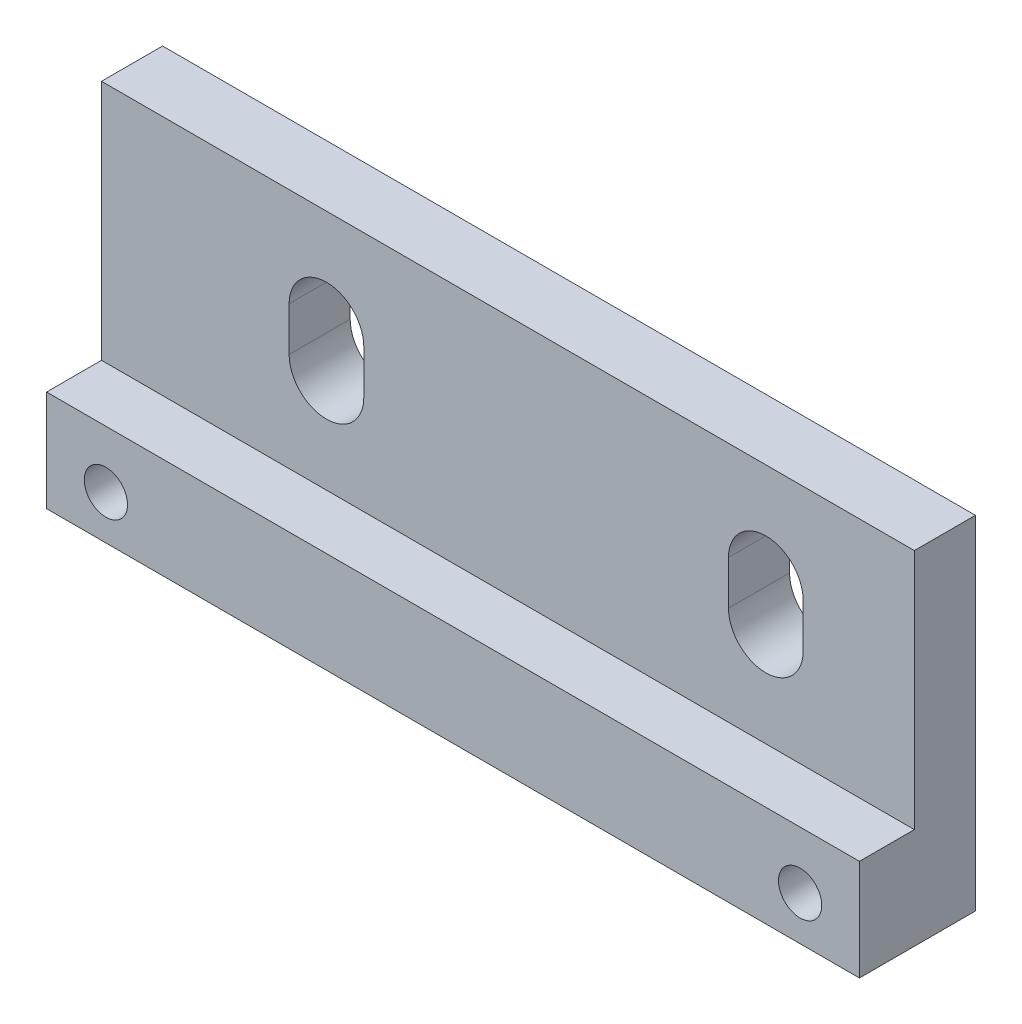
ISO-10303-21;
HEADER;
FILE_DESCRIPTION(('STEP AP214'),'2;1');
FILE_NAME('part.step','',(''),(''),'','','');
FILE_SCHEMA(('AUTOMOTIVE_DESIGN { 1 0 10303 214 1 1 1 1 }'));
ENDSEC;
DATA;
#1=APPLICATION_CONTEXT('core data for automotive mechanical design processes');
#2=APPLICATION_PROTOCOL_DEFINITION('international standard','automotive_design',2000,#1);
#3=PRODUCT_CONTEXT('',#1,'mechanical');
#4=PRODUCT('Part','Part','',(#3));
#5=PRODUCT_RELATED_PRODUCT_CATEGORY('part','',(#4));
#6=PRODUCT_DEFINITION_FORMATION('','',#4);
#7=PRODUCT_DEFINITION_CONTEXT('part definition',#1,'design');
#8=PRODUCT_DEFINITION('design','',#6,#7);
#9=PRODUCT_DEFINITION_SHAPE('','',#8);
#10=(LENGTH_UNIT() NAMED_UNIT(*) SI_UNIT(.MILLI.,.METRE.));
#11=(NAMED_UNIT(*) PLANE_ANGLE_UNIT() SI_UNIT($,.RADIAN.));
#12=(NAMED_UNIT(*) SI_UNIT($,.STERADIAN.) SOLID_ANGLE_UNIT());
#13=UNCERTAINTY_MEASURE_WITH_UNIT(LENGTH_MEASURE(1.E-05),#10,'distance_accuracy_value','');
#14=(GEOMETRIC_REPRESENTATION_CONTEXT(3) GLOBAL_UNCERTAINTY_ASSIGNED_CONTEXT((#13)) GLOBAL_UNIT_ASSIGNED_CONTEXT((#10,
#11,#12)) REPRESENTATION_CONTEXT('',''));
#15=CARTESIAN_POINT('',(0.,0.,0.));
#16=DIRECTION('',(0.,0.,1.));
#17=DIRECTION('',(1.,0.,0.));
#18=AXIS2_PLACEMENT_3D('',#15,#16,#17);
#19=CARTESIAN_POINT('',(-23.495,9.906,6.7056));
#20=DIRECTION('',(1.,0.,0.));
#21=DIRECTION('',(0.,0.,-1.));
#22=AXIS2_PLACEMENT_3D('',#19,#20,#21);
#23=PLANE('',#22);
#24=DIRECTION('',(0.,0.,1.));
#25=VECTOR('',#24,1.);
#26=CARTESIAN_POINT('',(-23.495,-4.06399999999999,6.7056));
#27=LINE('',#26,#25);
#28=CARTESIAN_POINT('',(-23.495,-4.06399999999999,3.5306));
#29=VERTEX_POINT('',#28);
#30=CARTESIAN_POINT('',(-23.495,-4.06399999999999,6.7056));
#31=VERTEX_POINT('',#30);
#32=EDGE_CURVE('E225',#29,#31,#27,.T.);
#33=ORIENTED_EDGE('',*,*,#32,.F.);
#34=DIRECTION('',(0.,-1.,0.));
#35=VECTOR('',#34,1.);
#36=CARTESIAN_POINT('',(-23.495,9.90600000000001,3.5306));
#37=LINE('',#36,#35);
#38=CARTESIAN_POINT('',(-23.495,9.90600000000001,3.5306));
#39=VERTEX_POINT('',#38);
#40=EDGE_CURVE('E213',#39,#29,#37,.T.);
#41=ORIENTED_EDGE('',*,*,#40,.F.);
#42=DIRECTION('',(0.,0.,-1.));
#43=VECTOR('',#42,1.);
#44=CARTESIAN_POINT('',(-23.495,9.906,6.7056));
#45=LINE('',#44,#43);
#46=CARTESIAN_POINT('',(-23.495,9.906,0.));
#47=VERTEX_POINT('',#46);
#48=EDGE_CURVE('E239',#39,#47,#45,.T.);
#49=ORIENTED_EDGE('',*,*,#48,.T.);
#50=DIRECTION('',(0.,-1.,0.));
#51=VECTOR('',#50,1.);
#52=CARTESIAN_POINT('',(-23.495,9.906,0.));
#53=LINE('',#52,#51);
#54=CARTESIAN_POINT('',(-23.495,-9.906,0.));
#55=VERTEX_POINT('',#54);
#56=EDGE_CURVE('E230',#47,#55,#53,.T.);
#57=ORIENTED_EDGE('',*,*,#56,.T.);
#58=DIRECTION('',(0.,0.,-1.));
#59=VECTOR('',#58,1.);
#60=CARTESIAN_POINT('',(-23.495,-9.906,6.7056));
#61=LINE('',#60,#59);
#62=CARTESIAN_POINT('',(-23.495,-9.906,6.7056));
#63=VERTEX_POINT('',#62);
#64=EDGE_CURVE('E11',#63,#55,#61,.T.);
#65=ORIENTED_EDGE('',*,*,#64,.F.);
#66=DIRECTION('',(0.,-1.,0.));
#67=VECTOR('',#66,1.);
#68=CARTESIAN_POINT('',(-23.495,9.906,6.7056));
#69=LINE('',#68,#67);
#70=EDGE_CURVE('E231',#31,#63,#69,.T.);
#71=ORIENTED_EDGE('',*,*,#70,.F.);
#72=EDGE_LOOP('',(#33,#41,#49,#57,#65,#71));
#73=FACE_BOUND('',#72,.T.);
#74=ADVANCED_FACE('F33',(#73),#23,.F.);
#75=CARTESIAN_POINT('',(-23.495,-9.906,6.7056));
#76=DIRECTION('',(0.,1.,0.));
#77=DIRECTION('',(0.,0.,1.));
#78=AXIS2_PLACEMENT_3D('',#75,#76,#77);
#79=PLANE('',#78);
#80=DIRECTION('',(1.,0.,0.));
#81=VECTOR('',#80,1.);
#82=CARTESIAN_POINT('',(-23.495,-9.906,0.));
#83=LINE('',#82,#81);
#84=CARTESIAN_POINT('',(23.495,-9.906,0.));
#85=VERTEX_POINT('',#84);
#86=EDGE_CURVE('E242',#55,#85,#83,.T.);
#87=ORIENTED_EDGE('',*,*,#86,.T.);
#88=DIRECTION('',(0.,0.,-1.));
#89=VECTOR('',#88,1.);
#90=CARTESIAN_POINT('',(23.495,-9.906,6.7056));
#91=LINE('',#90,#89);
#92=CARTESIAN_POINT('',(23.495,-9.906,6.7056));
#93=VERTEX_POINT('',#92);
#94=EDGE_CURVE('E40',#93,#85,#91,.T.);
#95=ORIENTED_EDGE('',*,*,#94,.F.);
#96=DIRECTION('',(1.,0.,0.));
#97=VECTOR('',#96,1.);
#98=CARTESIAN_POINT('',(-23.495,-9.906,6.7056));
#99=LINE('',#98,#97);
#100=EDGE_CURVE('E233',#63,#93,#99,.T.);
#101=ORIENTED_EDGE('',*,*,#100,.F.);
#102=ORIENTED_EDGE('',*,*,#64,.T.);
#103=EDGE_LOOP('',(#87,#95,#101,#102));
#104=FACE_BOUND('',#103,.T.);
#105=ADVANCED_FACE('F280',(#104),#79,.F.);
#106=CARTESIAN_POINT('',(23.495,9.906,6.7056));
#107=DIRECTION('',(-1.,0.,0.));
#108=DIRECTION('',(0.,-1.,0.));
#109=AXIS2_PLACEMENT_3D('',#106,#107,#108);
#110=PLANE('',#109);
#111=DIRECTION('',(0.,0.,-1.));
#112=VECTOR('',#111,1.);
#113=CARTESIAN_POINT('',(23.495,9.906,6.7056));
#114=LINE('',#113,#112);
#115=CARTESIAN_POINT('',(23.495,9.906,3.5306));
#116=VERTEX_POINT('',#115);
#117=CARTESIAN_POINT('',(23.495,9.906,0.));
#118=VERTEX_POINT('',#117);
#119=EDGE_CURVE('E250',#116,#118,#114,.T.);
#120=ORIENTED_EDGE('',*,*,#119,.F.);
#121=DIRECTION('',(0.,1.,0.));
#122=VECTOR('',#121,1.);
#123=CARTESIAN_POINT('',(23.495,9.906,3.5306));
#124=LINE('',#123,#122);
#125=CARTESIAN_POINT('',(23.495,-4.064,3.5306));
#126=VERTEX_POINT('',#125);
#127=EDGE_CURVE('E219',#126,#116,#124,.T.);
#128=ORIENTED_EDGE('',*,*,#127,.F.);
#129=DIRECTION('',(0.,0.,-1.));
#130=VECTOR('',#129,1.);
#131=CARTESIAN_POINT('',(23.495,-4.064,6.7056));
#132=LINE('',#131,#130);
#133=CARTESIAN_POINT('',(23.495,-4.064,6.7056));
#134=VERTEX_POINT('',#133);
#135=EDGE_CURVE('E216',#134,#126,#132,.T.);
#136=ORIENTED_EDGE('',*,*,#135,.F.);
#137=DIRECTION('',(0.,1.,0.));
#138=VECTOR('',#137,1.);
#139=CARTESIAN_POINT('',(23.495,9.906,6.7056));
#140=LINE('',#139,#138);
#141=EDGE_CURVE('E236',#93,#134,#140,.T.);
#142=ORIENTED_EDGE('',*,*,#141,.F.);
#143=ORIENTED_EDGE('',*,*,#94,.T.);
#144=DIRECTION('',(0.,1.,0.));
#145=VECTOR('',#144,1.);
#146=CARTESIAN_POINT('',(23.495,9.906,0.));
#147=LINE('',#146,#145);
#148=EDGE_CURVE('E244',#85,#118,#147,.T.);
#149=ORIENTED_EDGE('',*,*,#148,.T.);
#150=EDGE_LOOP('',(#120,#128,#136,#142,#143,#149));
#151=FACE_BOUND('',#150,.T.);
#152=ADVANCED_FACE('F257',(#151),#110,.F.);
#153=CARTESIAN_POINT('',(-23.495,9.906,6.7056));
#154=DIRECTION('',(0.,-1.,0.));
#155=DIRECTION('',(0.,0.,-1.));
#156=AXIS2_PLACEMENT_3D('',#153,#154,#155);
#157=PLANE('',#156);
#158=ORIENTED_EDGE('',*,*,#48,.F.);
#159=DIRECTION('',(1.,0.,0.));
#160=VECTOR('',#159,1.);
#161=CARTESIAN_POINT('',(-23.496,9.90600000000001,3.5306));
#162=LINE('',#161,#160);
#163=EDGE_CURVE('E222',#39,#116,#162,.T.);
#164=ORIENTED_EDGE('',*,*,#163,.T.);
#165=ORIENTED_EDGE('',*,*,#119,.T.);
#166=DIRECTION('',(-1.,0.,0.));
#167=VECTOR('',#166,1.);
#168=CARTESIAN_POINT('',(-23.495,9.906,0.));
#169=LINE('',#168,#167);
#170=EDGE_CURVE('E234',#118,#47,#169,.T.);
#171=ORIENTED_EDGE('',*,*,#170,.T.);
#172=EDGE_LOOP('',(#158,#164,#165,#171));
#173=FACE_BOUND('',#172,.T.);
#174=ADVANCED_FACE('F266',(#173),#157,.F.);
#175=CARTESIAN_POINT('',(-23.495,-9.906,6.7056));
#176=DIRECTION('',(0.,0.,1.));
#177=DIRECTION('',(1.,0.,0.));
#178=AXIS2_PLACEMENT_3D('',#175,#176,#177);
#179=PLANE('',#178);
#180=CARTESIAN_POINT('',(-20.066,-7.366,6.7056));
#181=DIRECTION('',(0.,0.,1.));
#182=DIRECTION('',(1.,0.,0.));
#183=AXIS2_PLACEMENT_3D('',#180,#181,#182);
#184=CIRCLE('',#183,1.24999999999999);
#185=CARTESIAN_POINT('',(-18.816,-7.366,6.7056));
#186=VERTEX_POINT('',#185);
#187=EDGE_CURVE('E204',#186,#186,#184,.T.);
#188=ORIENTED_EDGE('',*,*,#187,.F.);
#189=EDGE_LOOP('',(#188));
#190=FACE_BOUND('',#189,.T.);
#191=CARTESIAN_POINT('',(20.066,-7.366,6.7056));
#192=DIRECTION('',(0.,0.,1.));
#193=DIRECTION('',(1.,0.,0.));
#194=AXIS2_PLACEMENT_3D('',#191,#192,#193);
#195=CIRCLE('',#194,1.24999999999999);
#196=CARTESIAN_POINT('',(21.316,-7.366,6.7056));
#197=VERTEX_POINT('',#196);
#198=EDGE_CURVE('E210',#197,#197,#195,.T.);
#199=ORIENTED_EDGE('',*,*,#198,.F.);
#200=EDGE_LOOP('',(#199));
#201=FACE_BOUND('',#200,.T.);
#202=DIRECTION('',(1.,0.,0.));
#203=VECTOR('',#202,1.);
#204=CARTESIAN_POINT('',(-23.496,-4.06399999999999,6.7056));
#205=LINE('',#204,#203);
#206=EDGE_CURVE('E221',#31,#134,#205,.T.);
#207=ORIENTED_EDGE('',*,*,#206,.F.);
#208=ORIENTED_EDGE('',*,*,#70,.T.);
#209=ORIENTED_EDGE('',*,*,#100,.T.);
#210=ORIENTED_EDGE('',*,*,#141,.T.);
#211=EDGE_LOOP('',(#207,#208,#209,#210));
#212=FACE_BOUND('',#211,.T.);
#213=ADVANCED_FACE('F277',(#190,#201,#212),#179,.T.);
#214=CARTESIAN_POINT('',(-23.495,-9.906,0.));
#215=DIRECTION('',(0.,0.,1.));
#216=DIRECTION('',(1.,0.,0.));
#217=AXIS2_PLACEMENT_3D('',#214,#215,#216);
#218=PLANE('',#217);
#219=DIRECTION('',(0.,1.,0.));
#220=VECTOR('',#219,1.);
#221=CARTESIAN_POINT('',(17.0688,4.19100000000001,0.));
#222=LINE('',#221,#220);
#223=CARTESIAN_POINT('',(17.0688,1.65100000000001,0.));
#224=VERTEX_POINT('',#223);
#225=CARTESIAN_POINT('',(17.0688,4.19100000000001,0.));
#226=VERTEX_POINT('',#225);
#227=EDGE_CURVE('E141',#224,#226,#222,.T.);
#228=ORIENTED_EDGE('',*,*,#227,.T.);
#229=CARTESIAN_POINT('',(14.9098,4.19100000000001,0.));
#230=DIRECTION('',(0.,0.,1.));
#231=DIRECTION('',(1.,0.,0.));
#232=AXIS2_PLACEMENT_3D('',#229,#230,#231);
#233=CIRCLE('',#232,2.159);
#234=CARTESIAN_POINT('',(12.7508,4.19100000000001,0.));
#235=VERTEX_POINT('',#234);
#236=EDGE_CURVE('E135',#226,#235,#233,.T.);
#237=ORIENTED_EDGE('',*,*,#236,.T.);
#238=DIRECTION('',(0.,-1.,0.));
#239=VECTOR('',#238,1.);
#240=CARTESIAN_POINT('',(12.7508,4.19100000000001,0.));
#241=LINE('',#240,#239);
#242=CARTESIAN_POINT('',(12.7508,1.65100000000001,0.));
#243=VERTEX_POINT('',#242);
#244=EDGE_CURVE('E144',#235,#243,#241,.T.);
#245=ORIENTED_EDGE('',*,*,#244,.T.);
#246=CARTESIAN_POINT('',(14.9098,1.65100000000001,0.));
#247=DIRECTION('',(0.,0.,1.));
#248=DIRECTION('',(1.,0.,0.));
#249=AXIS2_PLACEMENT_3D('',#246,#247,#248);
#250=CIRCLE('',#249,2.159);
#251=EDGE_CURVE('E47',#243,#224,#250,.T.);
#252=ORIENTED_EDGE('',*,*,#251,.T.);
#253=EDGE_LOOP('',(#228,#237,#245,#252));
#254=FACE_BOUND('',#253,.T.);
#255=DIRECTION('',(0.,1.,0.));
#256=VECTOR('',#255,1.);
#257=CARTESIAN_POINT('',(-8.3312,4.19100000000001,0.));
#258=LINE('',#257,#256);
#259=CARTESIAN_POINT('',(-8.33119999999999,1.65100000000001,0.));
#260=VERTEX_POINT('',#259);
#261=CARTESIAN_POINT('',(-8.3312,4.19100000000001,0.));
#262=VERTEX_POINT('',#261);
#263=EDGE_CURVE('E180',#260,#262,#258,.T.);
#264=ORIENTED_EDGE('',*,*,#263,.T.);
#265=CARTESIAN_POINT('',(-10.4902,4.19100000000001,0.));
#266=DIRECTION('',(0.,0.,1.));
#267=DIRECTION('',(1.,0.,0.));
#268=AXIS2_PLACEMENT_3D('',#265,#266,#267);
#269=CIRCLE('',#268,2.159);
#270=CARTESIAN_POINT('',(-12.6492,4.19100000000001,0.));
#271=VERTEX_POINT('',#270);
#272=EDGE_CURVE('E170',#262,#271,#269,.T.);
#273=ORIENTED_EDGE('',*,*,#272,.T.);
#274=DIRECTION('',(0.,-1.,0.));
#275=VECTOR('',#274,1.);
#276=CARTESIAN_POINT('',(-12.6492,4.19100000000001,0.));
#277=LINE('',#276,#275);
#278=CARTESIAN_POINT('',(-12.6492,1.65100000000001,0.));
#279=VERTEX_POINT('',#278);
#280=EDGE_CURVE('E173',#271,#279,#277,.T.);
#281=ORIENTED_EDGE('',*,*,#280,.T.);
#282=CARTESIAN_POINT('',(-10.4902,1.65100000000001,0.));
#283=DIRECTION('',(0.,0.,1.));
#284=DIRECTION('',(1.,0.,0.));
#285=AXIS2_PLACEMENT_3D('',#282,#283,#284);
#286=CIRCLE('',#285,2.159);
#287=EDGE_CURVE('E177',#279,#260,#286,.T.);
#288=ORIENTED_EDGE('',*,*,#287,.T.);
#289=EDGE_LOOP('',(#264,#273,#281,#288));
#290=FACE_BOUND('',#289,.T.);
#291=CARTESIAN_POINT('',(-20.066,-7.366,0.));
#292=DIRECTION('',(0.,0.,1.));
#293=DIRECTION('',(1.,0.,0.));
#294=AXIS2_PLACEMENT_3D('',#291,#292,#293);
#295=CIRCLE('',#294,1.25);
#296=CARTESIAN_POINT('',(-18.816,-7.366,0.));
#297=VERTEX_POINT('',#296);
#298=EDGE_CURVE('E195',#297,#297,#295,.T.);
#299=ORIENTED_EDGE('',*,*,#298,.T.);
#300=EDGE_LOOP('',(#299));
#301=FACE_BOUND('',#300,.T.);
#302=CARTESIAN_POINT('',(20.066,-7.366,0.));
#303=DIRECTION('',(0.,0.,1.));
#304=DIRECTION('',(1.,0.,0.));
#305=AXIS2_PLACEMENT_3D('',#302,#303,#304);
#306=CIRCLE('',#305,1.25);
#307=CARTESIAN_POINT('',(21.316,-7.366,0.));
#308=VERTEX_POINT('',#307);
#309=EDGE_CURVE('E207',#308,#308,#306,.T.);
#310=ORIENTED_EDGE('',*,*,#309,.T.);
#311=EDGE_LOOP('',(#310));
#312=FACE_BOUND('',#311,.T.);
#313=ORIENTED_EDGE('',*,*,#56,.F.);
#314=ORIENTED_EDGE('',*,*,#170,.F.);
#315=ORIENTED_EDGE('',*,*,#148,.F.);
#316=ORIENTED_EDGE('',*,*,#86,.F.);
#317=EDGE_LOOP('',(#313,#314,#315,#316));
#318=FACE_BOUND('',#317,.T.);
#319=ADVANCED_FACE('F148',(#254,#290,#301,#312,#318),#218,.F.);
#320=CARTESIAN_POINT('',(-23.496,9.90600000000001,3.5306));
#321=DIRECTION('',(0.,0.,-1.));
#322=DIRECTION('',(0.,1.,0.));
#323=AXIS2_PLACEMENT_3D('',#320,#321,#322);
#324=PLANE('',#323);
#325=DIRECTION('',(0.,-1.,0.));
#326=VECTOR('',#325,1.);
#327=CARTESIAN_POINT('',(12.7508,4.19100000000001,3.5306));
#328=LINE('',#327,#326);
#329=CARTESIAN_POINT('',(12.7508,4.19100000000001,3.5306));
#330=VERTEX_POINT('',#329);
#331=CARTESIAN_POINT('',(12.7508,1.65100000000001,3.5306));
#332=VERTEX_POINT('',#331);
#333=EDGE_CURVE('E160',#330,#332,#328,.T.);
#334=ORIENTED_EDGE('',*,*,#333,.F.);
#335=CARTESIAN_POINT('',(14.9098,4.19100000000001,3.5306));
#336=DIRECTION('',(0.,0.,1.));
#337=DIRECTION('',(1.,0.,0.));
#338=AXIS2_PLACEMENT_3D('',#335,#336,#337);
#339=CIRCLE('',#338,2.159);
#340=CARTESIAN_POINT('',(17.0688,4.19100000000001,3.5306));
#341=VERTEX_POINT('',#340);
#342=EDGE_CURVE('E55',#341,#330,#339,.T.);
#343=ORIENTED_EDGE('',*,*,#342,.F.);
#344=DIRECTION('',(0.,1.,0.));
#345=VECTOR('',#344,1.);
#346=CARTESIAN_POINT('',(17.0688,4.19100000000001,3.5306));
#347=LINE('',#346,#345);
#348=CARTESIAN_POINT('',(17.0688,1.65100000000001,3.5306));
#349=VERTEX_POINT('',#348);
#350=EDGE_CURVE('E151',#349,#341,#347,.T.);
#351=ORIENTED_EDGE('',*,*,#350,.F.);
#352=CARTESIAN_POINT('',(14.9098,1.65100000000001,3.5306));
#353=DIRECTION('',(0.,0.,1.));
#354=DIRECTION('',(1.,0.,0.));
#355=AXIS2_PLACEMENT_3D('',#352,#353,#354);
#356=CIRCLE('',#355,2.159);
#357=EDGE_CURVE('E154',#332,#349,#356,.T.);
#358=ORIENTED_EDGE('',*,*,#357,.F.);
#359=EDGE_LOOP('',(#334,#343,#351,#358));
#360=FACE_BOUND('',#359,.T.);
#361=DIRECTION('',(0.,-1.,0.));
#362=VECTOR('',#361,1.);
#363=CARTESIAN_POINT('',(-12.6492,4.19100000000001,3.5306));
#364=LINE('',#363,#362);
#365=CARTESIAN_POINT('',(-12.6492,4.19100000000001,3.5306));
#366=VERTEX_POINT('',#365);
#367=CARTESIAN_POINT('',(-12.6492,1.65100000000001,3.5306));
#368=VERTEX_POINT('',#367);
#369=EDGE_CURVE('E185',#366,#368,#364,.T.);
#370=ORIENTED_EDGE('',*,*,#369,.F.);
#371=CARTESIAN_POINT('',(-10.4902,4.19100000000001,3.5306));
#372=DIRECTION('',(0.,0.,1.));
#373=DIRECTION('',(1.,0.,0.));
#374=AXIS2_PLACEMENT_3D('',#371,#372,#373);
#375=CIRCLE('',#374,2.159);
#376=CARTESIAN_POINT('',(-8.3312,4.19100000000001,3.5306));
#377=VERTEX_POINT('',#376);
#378=EDGE_CURVE('E166',#377,#366,#375,.T.);
#379=ORIENTED_EDGE('',*,*,#378,.F.);
#380=DIRECTION('',(0.,1.,0.));
#381=VECTOR('',#380,1.);
#382=CARTESIAN_POINT('',(-8.3312,4.19100000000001,3.5306));
#383=LINE('',#382,#381);
#384=CARTESIAN_POINT('',(-8.33119999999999,1.65100000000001,3.5306));
#385=VERTEX_POINT('',#384);
#386=EDGE_CURVE('E174',#385,#377,#383,.T.);
#387=ORIENTED_EDGE('',*,*,#386,.F.);
#388=CARTESIAN_POINT('',(-10.4902,1.65100000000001,3.5306));
#389=DIRECTION('',(0.,0.,1.));
#390=DIRECTION('',(1.,0.,0.));
#391=AXIS2_PLACEMENT_3D('',#388,#389,#390);
#392=CIRCLE('',#391,2.159);
#393=EDGE_CURVE('E188',#368,#385,#392,.T.);
#394=ORIENTED_EDGE('',*,*,#393,.F.);
#395=EDGE_LOOP('',(#370,#379,#387,#394));
#396=FACE_BOUND('',#395,.T.);
#397=ORIENTED_EDGE('',*,*,#40,.T.);
#398=DIRECTION('',(1.,0.,0.));
#399=VECTOR('',#398,1.);
#400=CARTESIAN_POINT('',(-23.496,-4.06399999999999,3.5306));
#401=LINE('',#400,#399);
#402=EDGE_CURVE('E226',#29,#126,#401,.T.);
#403=ORIENTED_EDGE('',*,*,#402,.T.);
#404=ORIENTED_EDGE('',*,*,#127,.T.);
#405=ORIENTED_EDGE('',*,*,#163,.F.);
#406=EDGE_LOOP('',(#397,#403,#404,#405));
#407=FACE_BOUND('',#406,.T.);
#408=ADVANCED_FACE('F269',(#360,#396,#407),#324,.F.);
#409=CARTESIAN_POINT('',(-23.496,-4.06399999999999,6.7056));
#410=DIRECTION('',(0.,-1.,0.));
#411=DIRECTION('',(1.,0.,0.));
#412=AXIS2_PLACEMENT_3D('',#409,#410,#411);
#413=PLANE('',#412);
#414=ORIENTED_EDGE('',*,*,#32,.T.);
#415=ORIENTED_EDGE('',*,*,#206,.T.);
#416=ORIENTED_EDGE('',*,*,#135,.T.);
#417=ORIENTED_EDGE('',*,*,#402,.F.);
#418=EDGE_LOOP('',(#414,#415,#416,#417));
#419=FACE_BOUND('',#418,.T.);
#420=ADVANCED_FACE('F273',(#419),#413,.F.);
#421=CARTESIAN_POINT('',(20.066,-7.366,6.7056));
#422=DIRECTION('',(0.,0.,1.));
#423=DIRECTION('',(1.,0.,0.));
#424=AXIS2_PLACEMENT_3D('',#421,#422,#423);
#425=CYLINDRICAL_SURFACE('',#424,1.24999999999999);
#426=ORIENTED_EDGE('',*,*,#309,.F.);
#427=EDGE_LOOP('',(#426));
#428=FACE_BOUND('',#427,.T.);
#429=ORIENTED_EDGE('',*,*,#198,.T.);
#430=EDGE_LOOP('',(#429));
#431=FACE_BOUND('',#430,.T.);
#432=ADVANCED_FACE('F297',(#428,#431),#425,.F.);
#433=CARTESIAN_POINT('',(-20.066,-7.366,6.7056));
#434=DIRECTION('',(0.,0.,1.));
#435=DIRECTION('',(1.,0.,0.));
#436=AXIS2_PLACEMENT_3D('',#433,#434,#435);
#437=CYLINDRICAL_SURFACE('',#436,1.24999999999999);
#438=ORIENTED_EDGE('',*,*,#298,.F.);
#439=EDGE_LOOP('',(#438));
#440=FACE_BOUND('',#439,.T.);
#441=ORIENTED_EDGE('',*,*,#187,.T.);
#442=EDGE_LOOP('',(#441));
#443=FACE_BOUND('',#442,.T.);
#444=ADVANCED_FACE('F303',(#440,#443),#437,.F.);
#445=CARTESIAN_POINT('',(-10.4902,4.19100000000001,0.));
#446=DIRECTION('',(0.,0.,1.));
#447=DIRECTION('',(1.,0.,0.));
#448=AXIS2_PLACEMENT_3D('',#445,#446,#447);
#449=CYLINDRICAL_SURFACE('',#448,2.159);
#450=ORIENTED_EDGE('',*,*,#378,.T.);
#451=DIRECTION('',(0.,0.,1.));
#452=VECTOR('',#451,1.);
#453=CARTESIAN_POINT('',(-12.6492,4.19100000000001,0.));
#454=LINE('',#453,#452);
#455=EDGE_CURVE('E183',#271,#366,#454,.T.);
#456=ORIENTED_EDGE('',*,*,#455,.F.);
#457=ORIENTED_EDGE('',*,*,#272,.F.);
#458=DIRECTION('',(0.,0.,1.));
#459=VECTOR('',#458,1.);
#460=CARTESIAN_POINT('',(-8.3312,4.19100000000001,0.));
#461=LINE('',#460,#459);
#462=EDGE_CURVE('E193',#262,#377,#461,.T.);
#463=ORIENTED_EDGE('',*,*,#462,.T.);
#464=EDGE_LOOP('',(#450,#456,#457,#463));
#465=FACE_BOUND('',#464,.T.);
#466=ADVANCED_FACE('F307',(#465),#449,.F.);
#467=CARTESIAN_POINT('',(-8.3312,4.19100000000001,0.));
#468=DIRECTION('',(1.,0.,0.));
#469=DIRECTION('',(0.,1.,0.));
#470=AXIS2_PLACEMENT_3D('',#467,#468,#469);
#471=PLANE('',#470);
#472=ORIENTED_EDGE('',*,*,#386,.T.);
#473=ORIENTED_EDGE('',*,*,#462,.F.);
#474=ORIENTED_EDGE('',*,*,#263,.F.);
#475=DIRECTION('',(0.,0.,1.));
#476=VECTOR('',#475,1.);
#477=CARTESIAN_POINT('',(-8.33119999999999,1.65100000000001,0.));
#478=LINE('',#477,#476);
#479=EDGE_CURVE('E196',#260,#385,#478,.T.);
#480=ORIENTED_EDGE('',*,*,#479,.T.);
#481=EDGE_LOOP('',(#472,#473,#474,#480));
#482=FACE_BOUND('',#481,.T.);
#483=ADVANCED_FACE('F311',(#482),#471,.F.);
#484=CARTESIAN_POINT('',(-10.4902,1.65100000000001,0.));
#485=DIRECTION('',(0.,0.,1.));
#486=DIRECTION('',(1.,0.,0.));
#487=AXIS2_PLACEMENT_3D('',#484,#485,#486);
#488=CYLINDRICAL_SURFACE('',#487,2.159);
#489=ORIENTED_EDGE('',*,*,#393,.T.);
#490=ORIENTED_EDGE('',*,*,#479,.F.);
#491=ORIENTED_EDGE('',*,*,#287,.F.);
#492=DIRECTION('',(0.,0.,1.));
#493=VECTOR('',#492,1.);
#494=CARTESIAN_POINT('',(-12.6492,1.65100000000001,0.));
#495=LINE('',#494,#493);
#496=EDGE_CURVE('E198',#279,#368,#495,.T.);
#497=ORIENTED_EDGE('',*,*,#496,.T.);
#498=EDGE_LOOP('',(#489,#490,#491,#497));
#499=FACE_BOUND('',#498,.T.);
#500=ADVANCED_FACE('F316',(#499),#488,.F.);
#501=CARTESIAN_POINT('',(-12.6492,4.19100000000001,0.));
#502=DIRECTION('',(-1.,0.,0.));
#503=DIRECTION('',(0.,0.,1.));
#504=AXIS2_PLACEMENT_3D('',#501,#502,#503);
#505=PLANE('',#504);
#506=ORIENTED_EDGE('',*,*,#369,.T.);
#507=ORIENTED_EDGE('',*,*,#496,.F.);
#508=ORIENTED_EDGE('',*,*,#280,.F.);
#509=ORIENTED_EDGE('',*,*,#455,.T.);
#510=EDGE_LOOP('',(#506,#507,#508,#509));
#511=FACE_BOUND('',#510,.T.);
#512=ADVANCED_FACE('F313',(#511),#505,.F.);
#513=CARTESIAN_POINT('',(14.9098,4.19100000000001,0.));
#514=DIRECTION('',(0.,0.,1.));
#515=DIRECTION('',(1.,0.,0.));
#516=AXIS2_PLACEMENT_3D('',#513,#514,#515);
#517=CYLINDRICAL_SURFACE('',#516,2.159);
#518=ORIENTED_EDGE('',*,*,#342,.T.);
#519=DIRECTION('',(0.,0.,1.));
#520=VECTOR('',#519,1.);
#521=CARTESIAN_POINT('',(12.7508,4.19100000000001,0.));
#522=LINE('',#521,#520);
#523=EDGE_CURVE('E131',#235,#330,#522,.T.);
#524=ORIENTED_EDGE('',*,*,#523,.F.);
#525=ORIENTED_EDGE('',*,*,#236,.F.);
#526=DIRECTION('',(0.,0.,1.));
#527=VECTOR('',#526,1.);
#528=CARTESIAN_POINT('',(17.0688,4.19100000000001,0.));
#529=LINE('',#528,#527);
#530=EDGE_CURVE('E164',#226,#341,#529,.T.);
#531=ORIENTED_EDGE('',*,*,#530,.T.);
#532=EDGE_LOOP('',(#518,#524,#525,#531));
#533=FACE_BOUND('',#532,.T.);
#534=ADVANCED_FACE('F133',(#533),#517,.F.);
#535=CARTESIAN_POINT('',(17.0688,4.19100000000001,0.));
#536=DIRECTION('',(1.,0.,0.));
#537=DIRECTION('',(0.,0.,-1.));
#538=AXIS2_PLACEMENT_3D('',#535,#536,#537);
#539=PLANE('',#538);
#540=ORIENTED_EDGE('',*,*,#350,.T.);
#541=ORIENTED_EDGE('',*,*,#530,.F.);
#542=ORIENTED_EDGE('',*,*,#227,.F.);
#543=DIRECTION('',(0.,0.,1.));
#544=VECTOR('',#543,1.);
#545=CARTESIAN_POINT('',(17.0688,1.65100000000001,0.));
#546=LINE('',#545,#544);
#547=EDGE_CURVE('E167',#224,#349,#546,.T.);
#548=ORIENTED_EDGE('',*,*,#547,.T.);
#549=EDGE_LOOP('',(#540,#541,#542,#548));
#550=FACE_BOUND('',#549,.T.);
#551=ADVANCED_FACE('F326',(#550),#539,.F.);
#552=CARTESIAN_POINT('',(14.9098,1.65100000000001,0.));
#553=DIRECTION('',(0.,0.,1.));
#554=DIRECTION('',(1.,0.,0.));
#555=AXIS2_PLACEMENT_3D('',#552,#553,#554);
#556=CYLINDRICAL_SURFACE('',#555,2.159);
#557=ORIENTED_EDGE('',*,*,#357,.T.);
#558=ORIENTED_EDGE('',*,*,#547,.F.);
#559=ORIENTED_EDGE('',*,*,#251,.F.);
#560=DIRECTION('',(0.,0.,1.));
#561=VECTOR('',#560,1.);
#562=CARTESIAN_POINT('',(12.7508,1.65100000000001,0.));
#563=LINE('',#562,#561);
#564=EDGE_CURVE('E140',#243,#332,#563,.T.);
#565=ORIENTED_EDGE('',*,*,#564,.T.);
#566=EDGE_LOOP('',(#557,#558,#559,#565));
#567=FACE_BOUND('',#566,.T.);
#568=ADVANCED_FACE('F329',(#567),#556,.F.);
#569=CARTESIAN_POINT('',(12.7508,4.19100000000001,0.));
#570=DIRECTION('',(-1.,0.,0.));
#571=DIRECTION('',(0.,0.,1.));
#572=AXIS2_PLACEMENT_3D('',#569,#570,#571);
#573=PLANE('',#572);
#574=ORIENTED_EDGE('',*,*,#333,.T.);
#575=ORIENTED_EDGE('',*,*,#564,.F.);
#576=ORIENTED_EDGE('',*,*,#244,.F.);
#577=ORIENTED_EDGE('',*,*,#523,.T.);
#578=EDGE_LOOP('',(#574,#575,#576,#577));
#579=FACE_BOUND('',#578,.T.);
#580=ADVANCED_FACE('F145',(#579),#573,.F.);
#581=CLOSED_SHELL('',(#74,#105,#152,#174,#213,#319,#408,#420,#432,#444,#466,#483,#500,#512,#534,
#551,#568,#580));
#582=MANIFOLD_SOLID_BREP('B2',#581);
#583=ADVANCED_BREP_SHAPE_REPRESENTATION('',(#18,#582),#14);
#584=SHAPE_DEFINITION_REPRESENTATION(#9,#583);
ENDSEC;
END-ISO-10303-21;
